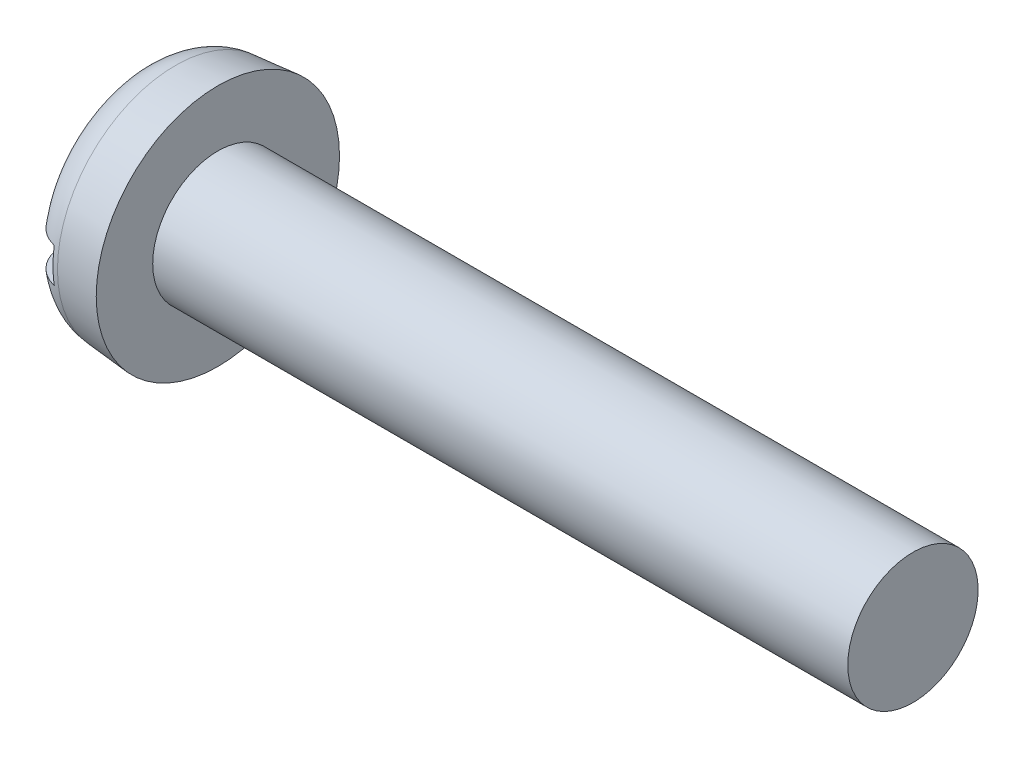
from build123d import *

# Parameters (mm, degrees)
FILLET2_R  = 0.9
SKETCH2_W  = 5.6
SKETCH2_H  = 0.8
SLOT_DEPTH = 0.7


with BuildPart() as part:
    # BodySke → Base-Revolve (revolve)
    with BuildSketch(Plane.XY, mode=Mode.PRIVATE) as base_revolve_sk:
        Polygon((1.8, 1.5), (1.8, 2.8), (0, 2.642520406), (0, 0), (17.8, 0), (17.8, 1.5), align=None)
    revolve(base_revolve_sk.sketch.rotate(Axis((-25.4, 0, 0), (1, 0, 0)), 90), axis=Axis((-25.4, 0, 0), (1, 0, 0)))

    # Fillet2
    fillet2_edges = [part.edges().sort_by_distance(p)[0] for p in [
        (0, 0, -2.642520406),
    ]]
    fillet(fillet2_edges, radius=FILLET2_R)

    # Sketch2 → Slot (cut)
    with BuildSketch(Plane(origin=(0, 0, 0), x_dir=(0, 0, -1), z_dir=(1, 0, 0))):
        Rectangle(SKETCH2_W, SKETCH2_H)
    extrude(amount=SLOT_DEPTH, mode=Mode.SUBTRACT)


solid = part.part
